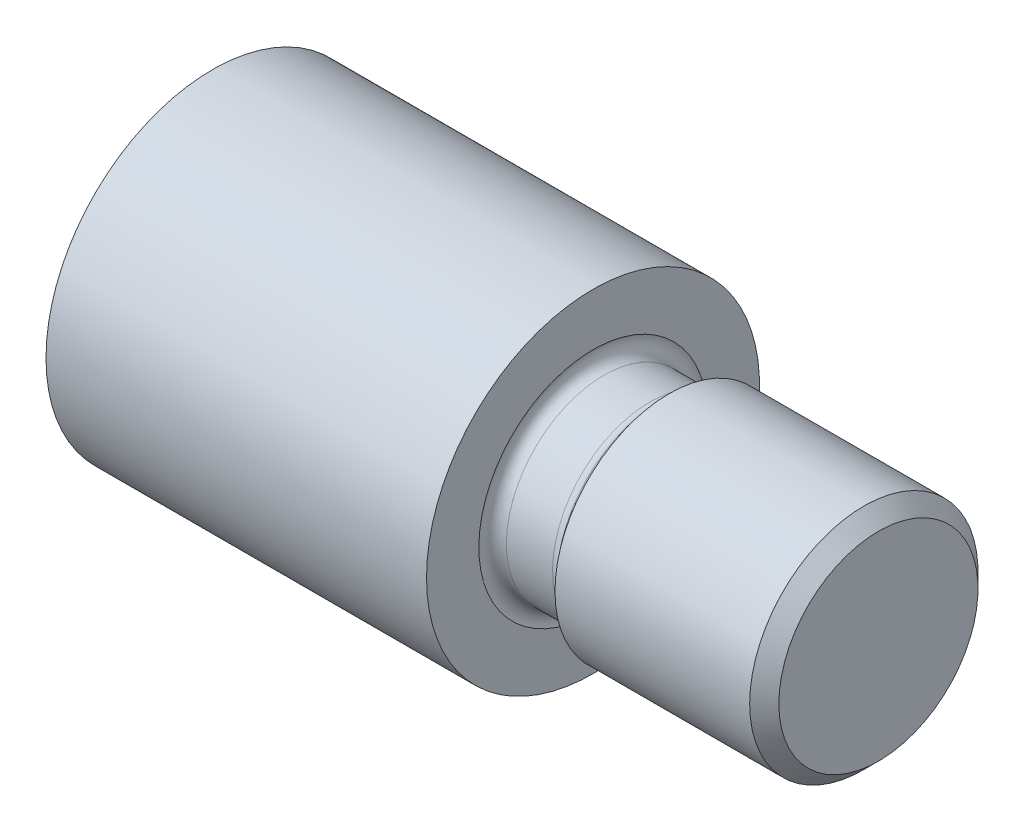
from build123d import *

# Parameters (mm, degrees)
CHAMFER1_SIZE = 3.065


with BuildPart() as part:
    # Skizze1 → Rotation1 (revolve)
    with BuildSketch(Plane.XY, mode=Mode.PRIVATE) as rotation1_sk:
        Polygon((70, 24), (10, 24), (10, 35), (-70, 35), (-70, 0), (70, 0), align=None)
    revolve(rotation1_sk.sketch.rotate(Axis((-69.393464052, 0, 0), (1, 0, 0)), 90), axis=Axis((-69.393464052, 0, 0), (1, 0, 0)))

    # Sketch3 → Cut-Revolve2 (revolve, cut)
    with BuildSketch(Plane(origin=(70, 0, 0), x_dir=(-1, 0, 0), z_dir=(0, 0, -1)), mode=Mode.PRIVATE) as cut_revolve2_sk:
        with BuildLine():
            Line((60, 24), (44, 24))
            Line((44, 24), (46.047247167, 21.438988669))
            ThreePointArc((46.047247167, 21.438988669), (46.916609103, 20.746943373), (48, 20.5))
            Line((48, 20.5), (57.708712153, 20.5))
            ThreePointArc((57.708712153, 20.5), (59.800362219, 21.630693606), (60, 24))
        make_face()
    revolve(cut_revolve2_sk.sketch.rotate(Axis((27.845248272, 0, 0), (1, 0, 0)), 180), axis=Axis((27.845248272, 0, 0), (1, 0, 0)), mode=Mode.SUBTRACT)

    # Chamfer1
    chamfer1_edges = [part.edges().sort_by_distance(p)[0] for p in [
        (70, 0, -24),
    ]]
    chamfer(chamfer1_edges, length=CHAMFER1_SIZE)


solid = part.part
